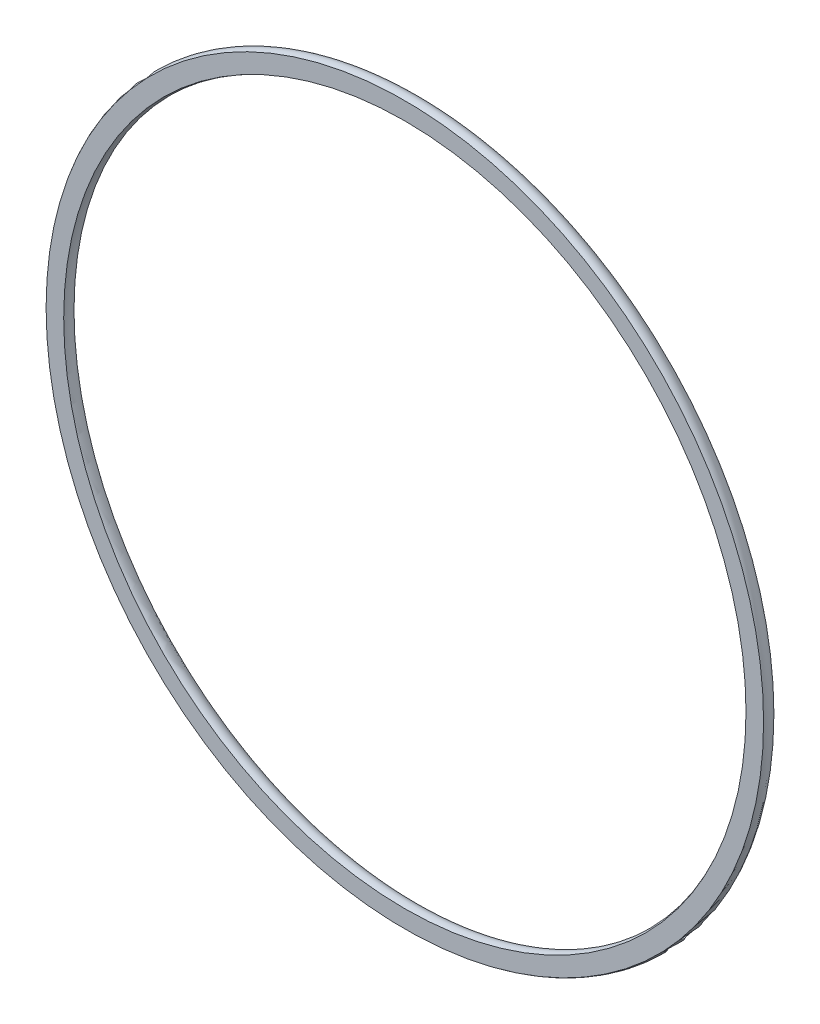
ISO-10303-21;
HEADER;
FILE_DESCRIPTION(('STEP AP214'),'2;1');
FILE_NAME('part.step','',(''),(''),'','','');
FILE_SCHEMA(('AUTOMOTIVE_DESIGN { 1 0 10303 214 1 1 1 1 }'));
ENDSEC;
DATA;
#1=APPLICATION_CONTEXT('core data for automotive mechanical design processes');
#2=APPLICATION_PROTOCOL_DEFINITION('international standard','automotive_design',2000,#1);
#3=PRODUCT_CONTEXT('',#1,'mechanical');
#4=PRODUCT('Part','Part','',(#3));
#5=PRODUCT_RELATED_PRODUCT_CATEGORY('part','',(#4));
#6=PRODUCT_DEFINITION_FORMATION('','',#4);
#7=PRODUCT_DEFINITION_CONTEXT('part definition',#1,'design');
#8=PRODUCT_DEFINITION('design','',#6,#7);
#9=PRODUCT_DEFINITION_SHAPE('','',#8);
#10=(LENGTH_UNIT() NAMED_UNIT(*) SI_UNIT(.MILLI.,.METRE.));
#11=(NAMED_UNIT(*) PLANE_ANGLE_UNIT() SI_UNIT($,.RADIAN.));
#12=(NAMED_UNIT(*) SI_UNIT($,.STERADIAN.) SOLID_ANGLE_UNIT());
#13=UNCERTAINTY_MEASURE_WITH_UNIT(LENGTH_MEASURE(1.E-05),#10,'distance_accuracy_value','');
#14=(GEOMETRIC_REPRESENTATION_CONTEXT(3) GLOBAL_UNCERTAINTY_ASSIGNED_CONTEXT((#13)) GLOBAL_UNIT_ASSIGNED_CONTEXT((#10,
#11,#12)) REPRESENTATION_CONTEXT('',''));
#15=CARTESIAN_POINT('',(0.,0.,0.));
#16=DIRECTION('',(0.,0.,1.));
#17=DIRECTION('',(1.,0.,0.));
#18=AXIS2_PLACEMENT_3D('',#15,#16,#17);
#19=CARTESIAN_POINT('',(0.,0.,0.));
#20=DIRECTION('',(0.,0.,1.));
#21=DIRECTION('',(1.,0.,0.));
#22=AXIS2_PLACEMENT_3D('',#19,#20,#21);
#23=TOROIDAL_SURFACE('',#22,30.9118,0.889);
#24=CARTESIAN_POINT('',(0.,0.,0.4318));
#25=DIRECTION('',(0.,0.,1.));
#26=DIRECTION('',(1.,0.,0.));
#27=AXIS2_PLACEMENT_3D('',#24,#25,#26);
#28=CIRCLE('',#27,30.1347094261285);
#29=CARTESIAN_POINT('',(30.1347094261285,0.,0.4318));
#30=VERTEX_POINT('',#29);
#31=EDGE_CURVE('E44',#30,#30,#28,.F.);
#32=ORIENTED_EDGE('',*,*,#31,.F.);
#33=EDGE_LOOP('',(#32));
#34=FACE_BOUND('',#33,.T.);
#35=CARTESIAN_POINT('',(0.,0.,0.4318));
#36=DIRECTION('',(0.,0.,-1.));
#37=DIRECTION('',(-1.,0.,0.));
#38=AXIS2_PLACEMENT_3D('',#35,#36,#37);
#39=CIRCLE('',#38,31.6888905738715);
#40=CARTESIAN_POINT('',(-31.6888905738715,0.,0.4318));
#41=VERTEX_POINT('',#40);
#42=EDGE_CURVE('E10',#41,#41,#39,.F.);
#43=ORIENTED_EDGE('',*,*,#42,.F.);
#44=EDGE_LOOP('',(#43));
#45=FACE_BOUND('',#44,.T.);
#46=ADVANCED_FACE('F37',(#34,#45),#23,.T.);
#47=CARTESIAN_POINT('',(0.,0.,0.4318));
#48=DIRECTION('',(0.,0.,-1.));
#49=DIRECTION('',(-1.,0.,0.));
#50=AXIS2_PLACEMENT_3D('',#47,#48,#49);
#51=PLANE('',#50);
#52=ORIENTED_EDGE('',*,*,#42,.T.);
#53=EDGE_LOOP('',(#52));
#54=FACE_BOUND('',#53,.T.);
#55=ORIENTED_EDGE('',*,*,#31,.T.);
#56=EDGE_LOOP('',(#55));
#57=FACE_BOUND('',#56,.T.);
#58=ADVANCED_FACE('F51',(#54,#57),#51,.F.);
#59=CLOSED_SHELL('',(#46,#58));
#60=MANIFOLD_SOLID_BREP('B2',#59);
#61=ADVANCED_BREP_SHAPE_REPRESENTATION('',(#18,#60),#14);
#62=SHAPE_DEFINITION_REPRESENTATION(#9,#61);
ENDSEC;
END-ISO-10303-21;
